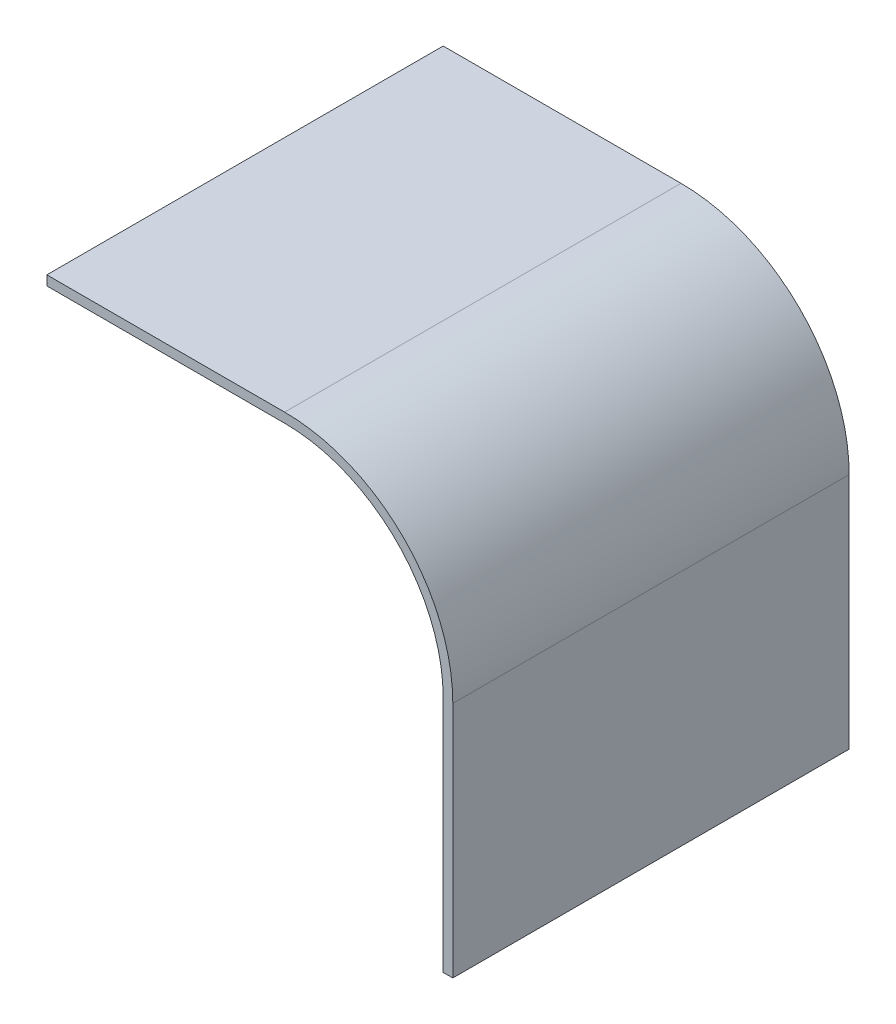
from build123d import *

# Parameters (mm, degrees)
EXTRUDE_THIN1_DEPTH = 50


with BuildPart() as part:
    # Sketch1 → Extrude-Thin1 (new body)
    with BuildSketch(Plane.XY):
        with BuildLine():
            Line((50, -50), (50, -20))
            ThreePointArc((50, -20), (44.142135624, -5.857864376), (30, 0))
            Line((30, 0), (0, 0))
            Line((0, 0), (0, 1.214))
            Line((0, 1.214), (30, 1.214))
            ThreePointArc((30, 1.214), (45.000563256, -4.999436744), (51.214, -20))
            Line((51.214, -20), (51.214, -50))
            Line((51.214, -50), (50, -50))
        make_face()
    extrude(amount=EXTRUDE_THIN1_DEPTH)


solid = part.part
